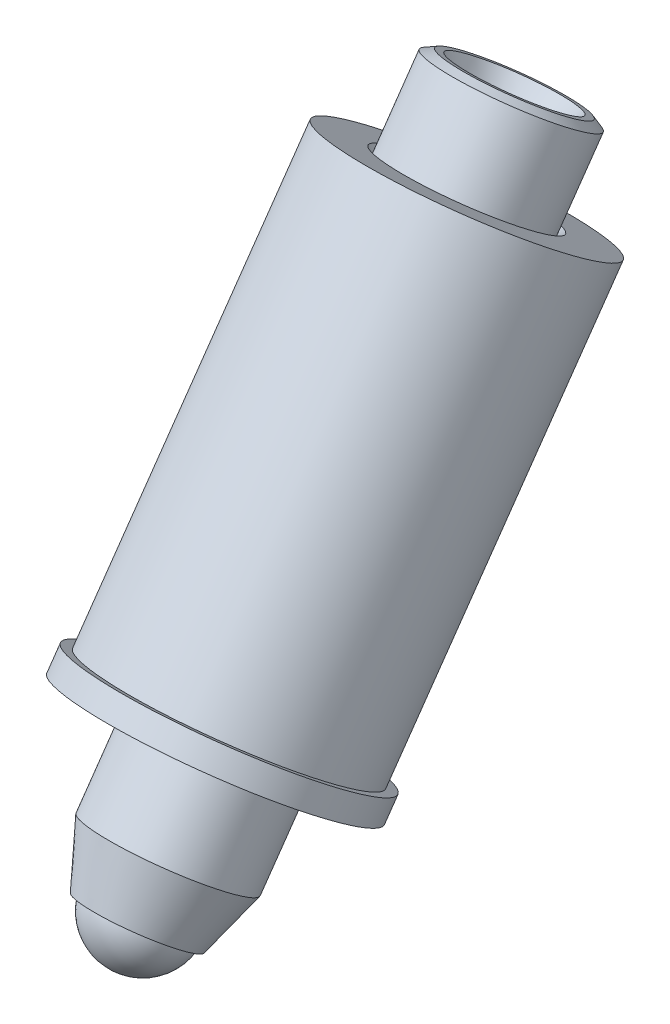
ISO-10303-21;
HEADER;
FILE_DESCRIPTION(('STEP AP214'),'2;1');
FILE_NAME('part.step','',(''),(''),'','','');
FILE_SCHEMA(('AUTOMOTIVE_DESIGN { 1 0 10303 214 1 1 1 1 }'));
ENDSEC;
DATA;
#1=APPLICATION_CONTEXT('core data for automotive mechanical design processes');
#2=APPLICATION_PROTOCOL_DEFINITION('international standard','automotive_design',2000,#1);
#3=PRODUCT_CONTEXT('',#1,'mechanical');
#4=PRODUCT('Part','Part','',(#3));
#5=PRODUCT_RELATED_PRODUCT_CATEGORY('part','',(#4));
#6=PRODUCT_DEFINITION_FORMATION('','',#4);
#7=PRODUCT_DEFINITION_CONTEXT('part definition',#1,'design');
#8=PRODUCT_DEFINITION('design','',#6,#7);
#9=PRODUCT_DEFINITION_SHAPE('','',#8);
#10=(LENGTH_UNIT() NAMED_UNIT(*) SI_UNIT(.MILLI.,.METRE.));
#11=(NAMED_UNIT(*) PLANE_ANGLE_UNIT() SI_UNIT($,.RADIAN.));
#12=(NAMED_UNIT(*) SI_UNIT($,.STERADIAN.) SOLID_ANGLE_UNIT());
#13=UNCERTAINTY_MEASURE_WITH_UNIT(LENGTH_MEASURE(1.E-05),#10,'distance_accuracy_value','');
#14=(GEOMETRIC_REPRESENTATION_CONTEXT(3) GLOBAL_UNCERTAINTY_ASSIGNED_CONTEXT((#13)) GLOBAL_UNIT_ASSIGNED_CONTEXT((#10,
#11,#12)) REPRESENTATION_CONTEXT('',''));
#15=CARTESIAN_POINT('',(0.,0.,0.));
#16=DIRECTION('',(0.,0.,1.));
#17=DIRECTION('',(1.,0.,0.));
#18=AXIS2_PLACEMENT_3D('',#15,#16,#17);
#19=CARTESIAN_POINT('',(10.8040317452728,7.16714205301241,12.9440832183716));
#20=DIRECTION('',(-0.877031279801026,-0.275646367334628,-0.393491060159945));
#21=DIRECTION('',(-0.409349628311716,0.,0.912377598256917));
#22=AXIS2_PLACEMENT_3D('',#19,#20,#21);
#23=PLANE('',#22);
#24=DIRECTION('',(0.,-0.819033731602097,0.573745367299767));
#25=VECTOR('',#24,1.);
#26=CARTESIAN_POINT('',(10.3879643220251,7.20007101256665,13.8483665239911));
#27=LINE('',#26,#25);
#28=CARTESIAN_POINT('',(10.3879643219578,7.20007101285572,13.8483665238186));
#29=VERTEX_POINT('',#28);
#30=CARTESIAN_POINT('',(10.3879643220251,4.32678473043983,15.8611464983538));
#31=VERTEX_POINT('',#30);
#32=EDGE_CURVE('E148',#29,#31,#27,.T.);
#33=ORIENTED_EDGE('',*,*,#32,.T.);
#34=DIRECTION('',(-0.48043327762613,0.503192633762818,0.718318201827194));
#35=VECTOR('',#34,1.);
#36=CARTESIAN_POINT('',(10.4622510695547,4.24897882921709,15.7500769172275));
#37=LINE('',#36,#35);
#38=CARTESIAN_POINT('',(10.4622510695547,4.24897882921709,15.7500769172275));
#39=VERTEX_POINT('',#38);
#40=EDGE_CURVE('E241',#39,#31,#37,.T.);
#41=ORIENTED_EDGE('',*,*,#40,.F.);
#42=DIRECTION('',(0.,0.819033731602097,-0.573745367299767));
#43=VECTOR('',#42,1.);
#44=CARTESIAN_POINT('',(10.4622510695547,5.06801256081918,15.1763315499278));
#45=LINE('',#44,#43);
#46=CARTESIAN_POINT('',(10.4622510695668,7.02860094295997,13.8029100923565));
#47=VERTEX_POINT('',#46);
#48=EDGE_CURVE('E240',#39,#47,#45,.T.);
#49=ORIENTED_EDGE('',*,*,#48,.T.);
#50=CARTESIAN_POINT('',(10.3879643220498,7.20007101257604,13.8483665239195));
#51=CARTESIAN_POINT('',(10.3937962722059,7.1853552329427,13.8456766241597));
#52=CARTESIAN_POINT('',(10.3997066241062,7.17070787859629,13.8427640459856));
#53=CARTESIAN_POINT('',(10.4116921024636,7.14162628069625,13.8364223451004));
#54=CARTESIAN_POINT('',(10.4177669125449,7.12719170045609,13.8329941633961));
#55=CARTESIAN_POINT('',(10.4301119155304,7.09855444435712,13.8255398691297));
#56=CARTESIAN_POINT('',(10.4363821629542,7.08435183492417,13.8215135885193));
#57=CARTESIAN_POINT('',(10.4491464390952,7.05623418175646,13.8127608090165));
#58=CARTESIAN_POINT('',(10.455640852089,7.04231970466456,13.8080330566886));
#59=CARTESIAN_POINT('',(10.4622510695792,7.02860094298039,13.8029100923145));
#60=B_SPLINE_CURVE_WITH_KNOTS('',3,(#50,#51,#52,#53,#54,#55,#56,#57,#58,#59),.UNSPECIFIED.,.F.,
.F.,(4,2,2,2,4),(0.,0.0481710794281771,0.0962552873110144,0.144353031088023,0.192537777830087),.UNSPECIFIED.);
#61=EDGE_CURVE('E20',#29,#47,#60,.T.);
#62=ORIENTED_EDGE('',*,*,#61,.F.);
#63=EDGE_LOOP('',(#33,#41,#49,#62));
#64=FACE_BOUND('',#63,.T.);
#65=ADVANCED_FACE('F16',(#64),#23,.F.);
#66=CARTESIAN_POINT('',(10.8040317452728,7.16714205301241,12.9440832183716));
#67=DIRECTION('',(-0.877031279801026,-0.275646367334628,-0.393491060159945));
#68=DIRECTION('',(-0.409349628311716,0.,0.912377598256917));
#69=AXIS2_PLACEMENT_3D('',#66,#67,#68);
#70=PLANE('',#69);
#71=DIRECTION('',(0.,0.819033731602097,-0.573745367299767));
#72=VECTOR('',#71,1.);
#73=CARTESIAN_POINT('',(10.7297449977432,4.78784675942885,14.7763889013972));
#74=LINE('',#73,#72);
#75=CARTESIAN_POINT('',(10.7297449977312,6.74843514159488,13.4029674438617));
#76=VERTEX_POINT('',#75);
#77=CARTESIAN_POINT('',(10.7297449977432,3.96881302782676,15.350134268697));
#78=VERTEX_POINT('',#77);
#79=EDGE_CURVE('E172',#76,#78,#74,.F.);
#80=ORIENTED_EDGE('',*,*,#79,.T.);
#81=DIRECTION('',(-0.480433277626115,0.503192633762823,0.7183182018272));
#82=VECTOR('',#81,1.);
#83=CARTESIAN_POINT('',(10.8040317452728,3.89100712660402,15.2390646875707));
#84=LINE('',#83,#82);
#85=CARTESIAN_POINT('',(10.8040317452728,3.89100712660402,15.2390646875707));
#86=VERTEX_POINT('',#85);
#87=EDGE_CURVE('E164',#86,#78,#84,.T.);
#88=ORIENTED_EDGE('',*,*,#87,.F.);
#89=DIRECTION('',(0.,0.819033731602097,-0.573745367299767));
#90=VECTOR('',#89,1.);
#91=CARTESIAN_POINT('',(10.8040317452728,7.1671420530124,12.9440832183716));
#92=LINE('',#91,#90);
#93=CARTESIAN_POINT('',(10.8040317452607,6.76429340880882,13.2262847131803));
#94=VERTEX_POINT('',#93);
#95=EDGE_CURVE('E169',#86,#94,#92,.T.);
#96=ORIENTED_EDGE('',*,*,#95,.T.);
#97=CARTESIAN_POINT('',(10.7297449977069,6.74843514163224,13.4029674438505));
#98=CARTESIAN_POINT('',(10.7363552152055,6.74830718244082,13.388323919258));
#99=CARTESIAN_POINT('',(10.7428496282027,6.74861751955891,13.3736314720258));
#100=CARTESIAN_POINT('',(10.7556139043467,6.74999726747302,13.3442153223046));
#101=CARTESIAN_POINT('',(10.76188415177,6.7510653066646,13.3294917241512));
#102=CARTESIAN_POINT('',(10.7742291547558,6.75384292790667,13.3000308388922));
#103=CARTESIAN_POINT('',(10.7803039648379,6.75555232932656,13.2852935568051));
#104=CARTESIAN_POINT('',(10.7922894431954,6.75952740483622,13.2557951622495));
#105=CARTESIAN_POINT('',(10.7981997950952,6.76179407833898,13.2410340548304));
#106=CARTESIAN_POINT('',(10.8040317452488,6.76429340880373,13.2262847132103));
#107=B_SPLINE_CURVE_WITH_KNOTS('',3,(#97,#98,#99,#100,#101,#102,#103,#104,#105,#106),
.UNSPECIFIED.,.F.,.F.,(4,2,2,2,4),(0.,0.0481847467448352,0.096282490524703,0.14436669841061,
0.192537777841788),.UNSPECIFIED.);
#108=EDGE_CURVE('E176',#76,#94,#107,.T.);
#109=ORIENTED_EDGE('',*,*,#108,.F.);
#110=EDGE_LOOP('',(#80,#88,#96,#109));
#111=FACE_BOUND('',#110,.T.);
#112=ADVANCED_FACE('F166',(#111),#70,.F.);
#113=CARTESIAN_POINT('',(11.2537714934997,4.3156307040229,15.8452238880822));
#114=DIRECTION('',(0.,0.819033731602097,-0.573745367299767));
#115=DIRECTION('',(0.,0.573745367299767,0.819033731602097));
#116=AXIS2_PLACEMENT_3D('',#113,#114,#115);
#117=PLANE('',#116);
#118=DIRECTION('',(0.999748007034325,-0.0128795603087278,-0.0183858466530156));
#119=VECTOR('',#118,1.);
#120=CARTESIAN_POINT('',(11.6698389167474,3.87985310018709,15.2231420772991));
#121=LINE('',#120,#119);
#122=CARTESIAN_POINT('',(10.9586172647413,3.88901563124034,15.2362217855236));
#123=VERTEX_POINT('',#122);
#124=EDGE_CURVE('E175',#123,#86,#121,.F.);
#125=ORIENTED_EDGE('',*,*,#124,.T.);
#126=ORIENTED_EDGE('',*,*,#87,.T.);
#127=CARTESIAN_POINT('',(11.2537714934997,4.31563070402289,15.8452238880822));
#128=DIRECTION('',(0.,0.819033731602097,-0.573745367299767));
#129=DIRECTION('',(0.,0.573745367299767,0.819033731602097));
#130=AXIS2_PLACEMENT_3D('',#127,#128,#129);
#131=CIRCLE('',#130,0.8);
#132=EDGE_CURVE('E180',#78,#123,#131,.F.);
#133=ORIENTED_EDGE('',*,*,#132,.T.);
#134=EDGE_LOOP('',(#125,#126,#133));
#135=FACE_BOUND('',#134,.T.);
#136=ADVANCED_FACE('F179',(#135),#117,.T.);
#137=CARTESIAN_POINT('',(11.6698389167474,7.15598802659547,12.9281606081));
#138=DIRECTION('',(-0.0224482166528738,-0.573600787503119,-0.818827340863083));
#139=DIRECTION('',(0.,0.819033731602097,-0.573745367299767));
#140=AXIS2_PLACEMENT_3D('',#137,#138,#139);
#141=PLANE('',#140);
#142=ORIENTED_EDGE('',*,*,#95,.F.);
#143=ORIENTED_EDGE('',*,*,#124,.F.);
#144=DIRECTION('',(0.,0.819033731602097,-0.573745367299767));
#145=VECTOR('',#144,1.);
#146=CARTESIAN_POINT('',(10.9586172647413,4.70804936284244,14.6624764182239));
#147=LINE('',#146,#145);
#148=CARTESIAN_POINT('',(10.9586172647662,6.66863774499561,13.2890549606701));
#149=VERTEX_POINT('',#148);
#150=EDGE_CURVE('E498',#123,#149,#147,.T.);
#151=ORIENTED_EDGE('',*,*,#150,.T.);
#152=CARTESIAN_POINT('',(10.8040317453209,6.7642934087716,13.2262847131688));
#153=CARTESIAN_POINT('',(10.8161676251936,6.75552950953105,13.2320912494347));
#154=CARTESIAN_POINT('',(10.8284666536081,6.74691404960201,13.237789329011));
#155=CARTESIAN_POINT('',(10.8534075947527,6.73006440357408,13.2489089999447));
#156=CARTESIAN_POINT('',(10.8660488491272,6.72182955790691,13.2543310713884));
#157=CARTESIAN_POINT('',(10.891737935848,6.70579117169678,13.2648619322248));
#158=CARTESIAN_POINT('',(10.9047858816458,6.69798775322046,13.2699706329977));
#159=CARTESIAN_POINT('',(10.9313474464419,6.68289686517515,13.2798138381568));
#160=CARTESIAN_POINT('',(10.9448618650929,6.67561035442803,13.2845476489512));
#161=CARTESIAN_POINT('',(10.9586172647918,6.66863774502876,13.2890549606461));
#162=B_SPLINE_CURVE_WITH_KNOTS('',3,(#152,#153,#154,#155,#156,#157,#158,#159,#160,#161),
.UNSPECIFIED.,.F.,.F.,(4,2,2,2,4),(0.,0.048171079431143,0.0962552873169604,0.144353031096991,
0.192537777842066),.UNSPECIFIED.);
#163=EDGE_CURVE('E186',#94,#149,#162,.T.);
#164=ORIENTED_EDGE('',*,*,#163,.F.);
#165=EDGE_LOOP('',(#142,#143,#151,#164));
#166=FACE_BOUND('',#165,.T.);
#167=ADVANCED_FACE('F185',(#166),#141,.F.);
#168=CARTESIAN_POINT('',(11.6698389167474,7.15598802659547,12.9281606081));
#169=DIRECTION('',(-0.0224482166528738,-0.573600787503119,-0.818827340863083));
#170=DIRECTION('',(0.,0.819033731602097,-0.573745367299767));
#171=AXIS2_PLACEMENT_3D('',#168,#169,#170);
#172=PLANE('',#171);
#173=DIRECTION('',(0.,0.819033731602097,-0.573745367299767));
#174=VECTOR('',#173,1.);
#175=CARTESIAN_POINT('',(11.5152533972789,4.70087832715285,14.6522396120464));
#176=LINE('',#175,#174);
#177=CARTESIAN_POINT('',(11.515253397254,6.66146670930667,13.2788181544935));
#178=VERTEX_POINT('',#177);
#179=CARTESIAN_POINT('',(11.5152533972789,3.88184459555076,15.2259849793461));
#180=VERTEX_POINT('',#179);
#181=EDGE_CURVE('E494',#178,#180,#176,.F.);
#182=ORIENTED_EDGE('',*,*,#181,.T.);
#183=DIRECTION('',(-0.999748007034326,0.0128795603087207,0.0183858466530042));
#184=VECTOR('',#183,1.);
#185=CARTESIAN_POINT('',(11.6698389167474,3.87985310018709,15.2231420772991));
#186=LINE('',#185,#184);
#187=CARTESIAN_POINT('',(11.6698389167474,3.87985310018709,15.2231420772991));
#188=VERTEX_POINT('',#187);
#189=EDGE_CURVE('E195',#188,#180,#186,.T.);
#190=ORIENTED_EDGE('',*,*,#189,.F.);
#191=DIRECTION('',(0.,0.819033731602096,-0.573745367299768));
#192=VECTOR('',#191,1.);
#193=CARTESIAN_POINT('',(11.6698389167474,3.87985310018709,15.2231420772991));
#194=LINE('',#193,#192);
#195=CARTESIAN_POINT('',(11.6698389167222,6.75313938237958,13.2103621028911));
#196=VERTEX_POINT('',#195);
#197=EDGE_CURVE('E201',#188,#196,#194,.T.);
#198=ORIENTED_EDGE('',*,*,#197,.T.);
#199=CARTESIAN_POINT('',(11.5152533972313,6.66146670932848,13.27881815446));
#200=CARTESIAN_POINT('',(11.5290087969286,6.66808490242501,13.27380490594));
#201=CARTESIAN_POINT('',(11.5425232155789,6.67502320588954,13.2685740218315));
#202=CARTESIAN_POINT('',(11.5690847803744,6.6894297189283,13.2577538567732));
#203=CARTESIAN_POINT('',(11.5821327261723,6.69689694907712,13.252165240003));
#204=CARTESIAN_POINT('',(11.6078218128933,6.71227344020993,13.2406895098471));
#205=CARTESIAN_POINT('',(11.6204630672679,6.72018257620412,13.2348024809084));
#206=CARTESIAN_POINT('',(11.6454040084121,6.73638960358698,13.2227654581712));
#207=CARTESIAN_POINT('',(11.657703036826,6.74468817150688,13.2166150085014));
#208=CARTESIAN_POINT('',(11.6698389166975,6.75313938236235,13.2103621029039));
#209=B_SPLINE_CURVE_WITH_KNOTS('',3,(#199,#200,#201,#202,#203,#204,#205,#206,#207,#208),
.UNSPECIFIED.,.F.,.F.,(4,2,2,2,4),(0.,0.0481847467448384,0.0962824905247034,0.14436669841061,
0.192537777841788),.UNSPECIFIED.);
#210=EDGE_CURVE('E188',#178,#196,#209,.T.);
#211=ORIENTED_EDGE('',*,*,#210,.F.);
#212=EDGE_LOOP('',(#182,#190,#198,#211));
#213=FACE_BOUND('',#212,.T.);
#214=ADVANCED_FACE('F625',(#213),#172,.F.);
#215=CARTESIAN_POINT('',(11.2537714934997,4.3156307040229,15.8452238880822));
#216=DIRECTION('',(0.,0.819033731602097,-0.573745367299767));
#217=DIRECTION('',(0.,0.573745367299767,0.819033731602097));
#218=AXIS2_PLACEMENT_3D('',#215,#216,#217);
#219=PLANE('',#218);
#220=DIRECTION('',(-0.519314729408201,-0.49031307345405,-0.69993235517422));
#221=VECTOR('',#220,1.);
#222=CARTESIAN_POINT('',(11.7501376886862,3.95566750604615,15.3313687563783));
#223=LINE('',#222,#221);
#224=CARTESIAN_POINT('',(11.7501376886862,3.95566750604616,15.3313687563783));
#225=VERTEX_POINT('',#224);
#226=EDGE_CURVE('E198',#225,#188,#223,.T.);
#227=ORIENTED_EDGE('',*,*,#226,.T.);
#228=ORIENTED_EDGE('',*,*,#189,.T.);
#229=CARTESIAN_POINT('',(11.2537714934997,4.31563070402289,15.8452238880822));
#230=DIRECTION('',(0.,0.819033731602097,-0.573745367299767));
#231=DIRECTION('',(0.,0.573745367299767,0.819033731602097));
#232=AXIS2_PLACEMENT_3D('',#229,#230,#231);
#233=CIRCLE('',#232,0.8);
#234=EDGE_CURVE('E489',#180,#225,#233,.F.);
#235=ORIENTED_EDGE('',*,*,#234,.T.);
#236=EDGE_LOOP('',(#227,#228,#235));
#237=FACE_BOUND('',#236,.T.);
#238=ADVANCED_FACE('F519',(#237),#219,.T.);
#239=CARTESIAN_POINT('',(12.1195786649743,7.58061160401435,13.5343198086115));
#240=DIRECTION('',(0.854583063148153,-0.297954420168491,-0.425336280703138));
#241=DIRECTION('',(-0.445574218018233,0.,-0.895245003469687));
#242=AXIS2_PLACEMENT_3D('',#239,#240,#241);
#243=PLANE('',#242);
#244=ORIENTED_EDGE('',*,*,#197,.F.);
#245=ORIENTED_EDGE('',*,*,#226,.F.);
#246=DIRECTION('',(0.,0.819033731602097,-0.573745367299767));
#247=VECTOR('',#246,1.);
#248=CARTESIAN_POINT('',(11.7501376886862,4.77470123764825,14.7576233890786));
#249=LINE('',#248,#247);
#250=CARTESIAN_POINT('',(11.7501376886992,6.73528961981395,13.3842019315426));
#251=VERTEX_POINT('',#250);
#252=EDGE_CURVE('E458',#225,#251,#249,.T.);
#253=ORIENTED_EDGE('',*,*,#252,.T.);
#254=CARTESIAN_POINT('',(11.669838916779,6.7531393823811,13.210362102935));
#255=CARTESIAN_POINT('',(11.6761428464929,6.75048370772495,13.2248882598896));
#256=CARTESIAN_POINT('',(11.6825315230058,6.74805858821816,13.2394231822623));
#257=CARTESIAN_POINT('',(11.6954869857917,6.74376220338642,13.2684629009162));
#258=CARTESIAN_POINT('',(11.7020534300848,6.74188994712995,13.2829677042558));
#259=CARTESIAN_POINT('',(11.7153975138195,6.73878137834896,13.311956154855));
#260=CARTESIAN_POINT('',(11.7221752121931,6.73754524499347,13.3264397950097));
#261=CARTESIAN_POINT('',(11.7359725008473,6.73582330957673,13.3553674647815));
#262=CARTESIAN_POINT('',(11.7429925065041,6.73533886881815,13.3698113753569));
#263=CARTESIAN_POINT('',(11.7501376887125,6.73528961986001,13.3842019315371));
#264=B_SPLINE_CURVE_WITH_KNOTS('',3,(#254,#255,#256,#257,#258,#259,#260,#261,#262,#263),
.UNSPECIFIED.,.F.,.F.,(4,2,2,2,4),(0.,0.0481710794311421,0.0962552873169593,0.144353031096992,
0.192537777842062),.UNSPECIFIED.);
#265=EDGE_CURVE('E204',#196,#251,#264,.T.);
#266=ORIENTED_EDGE('',*,*,#265,.F.);
#267=EDGE_LOOP('',(#244,#245,#253,#266));
#268=FACE_BOUND('',#267,.T.);
#269=ADVANCED_FACE('F524',(#268),#243,.F.);
#270=CARTESIAN_POINT('',(11.2537714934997,2.6775632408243,16.9927146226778));
#271=DIRECTION('',(0.,0.819033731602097,-0.573745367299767));
#272=DIRECTION('',(0.,0.573745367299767,0.819033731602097));
#273=AXIS2_PLACEMENT_3D('',#270,#271,#272);
#274=CONICAL_SURFACE('',#273,0.800000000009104,1.04719755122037);
#275=CARTESIAN_POINT('',(11.2537714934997,2.29926776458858,17.2577162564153));
#276=VERTEX_POINT('',#275);
#277=VERTEX_LOOP('',#276);
#278=FACE_BOUND('',#277,.T.);
#279=CARTESIAN_POINT('',(11.2537714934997,2.67756324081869,16.9927146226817));
#280=DIRECTION('',(0.,0.819033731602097,-0.573745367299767));
#281=DIRECTION('',(0.,0.573745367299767,0.819033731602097));
#282=AXIS2_PLACEMENT_3D('',#279,#280,#281);
#283=CIRCLE('',#282,0.8);
#284=CARTESIAN_POINT('',(11.2537714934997,3.13655953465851,17.6479416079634));
#285=VERTEX_POINT('',#284);
#286=EDGE_CURVE('E456',#285,#285,#283,.T.);
#287=ORIENTED_EDGE('',*,*,#286,.T.);
#288=EDGE_LOOP('',(#287));
#289=FACE_BOUND('',#288,.T.);
#290=ADVANCED_FACE('F614',(#278,#289),#274,.F.);
#291=CARTESIAN_POINT('',(11.7035112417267,8.01638920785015,14.1564016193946));
#292=DIRECTION('',(0.877031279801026,0.275646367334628,0.393491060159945));
#293=DIRECTION('',(0.409349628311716,0.,-0.912377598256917));
#294=AXIS2_PLACEMENT_3D('',#291,#292,#293);
#295=PLANE('',#294);
#296=DIRECTION('',(0.,0.819033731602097,-0.573745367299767));
#297=VECTOR('',#296,1.);
#298=CARTESIAN_POINT('',(11.7777979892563,5.48148211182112,15.7665681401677));
#299=LINE('',#298,#297);
#300=CARTESIAN_POINT('',(11.7777979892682,7.44207049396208,14.3931466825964));
#301=VERTEX_POINT('',#300);
#302=CARTESIAN_POINT('',(11.7777979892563,4.66244838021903,16.3403135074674));
#303=VERTEX_POINT('',#302);
#304=EDGE_CURVE('E455',#301,#303,#299,.F.);
#305=ORIENTED_EDGE('',*,*,#304,.T.);
#306=DIRECTION('',(0.480433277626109,-0.503192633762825,-0.718318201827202));
#307=VECTOR('',#306,1.);
#308=CARTESIAN_POINT('',(11.7035112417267,4.74025428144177,16.4513830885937));
#309=LINE('',#308,#307);
#310=CARTESIAN_POINT('',(11.7035112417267,4.74025428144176,16.4513830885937));
#311=VERTEX_POINT('',#310);
#312=EDGE_CURVE('E207',#311,#303,#309,.T.);
#313=ORIENTED_EDGE('',*,*,#312,.F.);
#314=DIRECTION('',(0.,-0.819033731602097,0.573745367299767));
#315=VECTOR('',#314,1.);
#316=CARTESIAN_POINT('',(11.7035112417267,8.01638920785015,14.1564016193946));
#317=LINE('',#316,#315);
#318=CARTESIAN_POINT('',(11.7035112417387,7.61354056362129,14.4386031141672));
#319=VERTEX_POINT('',#318);
#320=EDGE_CURVE('E214',#311,#319,#317,.F.);
#321=ORIENTED_EDGE('',*,*,#320,.T.);
#322=CARTESIAN_POINT('',(11.7777979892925,7.44207049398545,14.3931466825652));
#323=CARTESIAN_POINT('',(11.771187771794,7.45578925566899,14.3982696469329));
#324=CARTESIAN_POINT('',(11.7646933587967,7.46970373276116,14.4029973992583));
#325=CARTESIAN_POINT('',(11.7519290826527,7.49782138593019,14.4117501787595));
#326=CARTESIAN_POINT('',(11.7456588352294,7.51202399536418,14.4157764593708));
#327=CARTESIAN_POINT('',(11.7333138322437,7.54066125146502,14.423230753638));
#328=CARTESIAN_POINT('',(11.7272390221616,7.555095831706,14.4266589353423));
#329=CARTESIAN_POINT('',(11.715253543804,7.58417742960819,14.4330006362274));
#330=CARTESIAN_POINT('',(11.7093431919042,7.59882478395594,14.4359132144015));
#331=CARTESIAN_POINT('',(11.7035112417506,7.61354056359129,14.4386031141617));
#332=B_SPLINE_CURVE_WITH_KNOTS('',3,(#322,#323,#324,#325,#326,#327,#328,#329,#330,#331),
.UNSPECIFIED.,.F.,.F.,(4,2,2,2,4),(0.,0.0481847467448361,0.0962824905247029,0.144366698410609,
0.192537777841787),.UNSPECIFIED.);
#333=EDGE_CURVE('E211',#301,#319,#332,.T.);
#334=ORIENTED_EDGE('',*,*,#333,.F.);
#335=EDGE_LOOP('',(#305,#313,#321,#334));
#336=FACE_BOUND('',#335,.T.);
#337=ADVANCED_FACE('F610',(#336),#295,.F.);
#338=CARTESIAN_POINT('',(11.2537714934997,4.3156307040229,15.8452238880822));
#339=DIRECTION('',(0.,0.819033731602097,-0.573745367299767));
#340=DIRECTION('',(0.,0.573745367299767,0.819033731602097));
#341=AXIS2_PLACEMENT_3D('',#338,#339,#340);
#342=PLANE('',#341);
#343=DIRECTION('',(0.999748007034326,-0.0128795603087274,-0.018385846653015));
#344=VECTOR('',#343,1.);
#345=CARTESIAN_POINT('',(10.8377040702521,4.75140830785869,16.4673056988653));
#346=LINE('',#345,#344);
#347=CARTESIAN_POINT('',(11.5489257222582,4.74224577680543,16.4542259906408));
#348=VERTEX_POINT('',#347);
#349=EDGE_CURVE('E210',#348,#311,#346,.T.);
#350=ORIENTED_EDGE('',*,*,#349,.T.);
#351=ORIENTED_EDGE('',*,*,#312,.T.);
#352=CARTESIAN_POINT('',(11.2537714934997,4.31563070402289,15.8452238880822));
#353=DIRECTION('',(0.,0.819033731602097,-0.573745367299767));
#354=DIRECTION('',(0.,0.573745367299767,0.819033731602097));
#355=AXIS2_PLACEMENT_3D('',#352,#353,#354);
#356=CIRCLE('',#355,0.8);
#357=EDGE_CURVE('E479',#303,#348,#356,.F.);
#358=ORIENTED_EDGE('',*,*,#357,.T.);
#359=EDGE_LOOP('',(#350,#351,#358));
#360=FACE_BOUND('',#359,.T.);
#361=ADVANCED_FACE('F606',(#360),#342,.T.);
#362=CARTESIAN_POINT('',(10.8377040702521,8.02754323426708,14.1723242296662));
#363=DIRECTION('',(0.0224482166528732,0.573600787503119,0.818827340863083));
#364=DIRECTION('',(0.,-0.819033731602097,0.573745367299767));
#365=AXIS2_PLACEMENT_3D('',#362,#363,#364);
#366=PLANE('',#365);
#367=ORIENTED_EDGE('',*,*,#320,.F.);
#368=ORIENTED_EDGE('',*,*,#349,.F.);
#369=DIRECTION('',(0.,0.819033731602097,-0.573745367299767));
#370=VECTOR('',#369,1.);
#371=CARTESIAN_POINT('',(11.5489257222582,5.56127950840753,15.880480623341));
#372=LINE('',#371,#370);
#373=CARTESIAN_POINT('',(11.5489257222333,7.52186789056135,14.5070591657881));
#374=VERTEX_POINT('',#373);
#375=EDGE_CURVE('E476',#348,#374,#372,.T.);
#376=ORIENTED_EDGE('',*,*,#375,.T.);
#377=CARTESIAN_POINT('',(11.7035112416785,7.61354056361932,14.4386031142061));
#378=CARTESIAN_POINT('',(11.6913753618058,7.60508935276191,14.4448560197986));
#379=CARTESIAN_POINT('',(11.6790763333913,7.59679078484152,14.4510064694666));
#380=CARTESIAN_POINT('',(11.6541353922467,7.58058375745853,14.4630434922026));
#381=CARTESIAN_POINT('',(11.6414941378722,7.57267462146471,14.468930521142));
#382=CARTESIAN_POINT('',(11.6158050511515,7.55729813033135,14.4804062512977));
#383=CARTESIAN_POINT('',(11.6027571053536,7.54983090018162,14.4859948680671));
#384=CARTESIAN_POINT('',(11.5761955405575,7.53542438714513,14.4968150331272));
#385=CARTESIAN_POINT('',(11.5626811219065,7.52848608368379,14.5020459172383));
#386=CARTESIAN_POINT('',(11.5489257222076,7.52186789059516,14.5070591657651));
#387=B_SPLINE_CURVE_WITH_KNOTS('',3,(#377,#378,#379,#380,#381,#382,#383,#384,#385,#386),
.UNSPECIFIED.,.F.,.F.,(4,2,2,2,4),(0.,0.0481710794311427,0.0962552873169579,0.14435303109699,
0.192537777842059),.UNSPECIFIED.);
#388=EDGE_CURVE('E217',#319,#374,#387,.T.);
#389=ORIENTED_EDGE('',*,*,#388,.F.);
#390=EDGE_LOOP('',(#367,#368,#376,#389));
#391=FACE_BOUND('',#390,.T.);
#392=ADVANCED_FACE('F353',(#391),#366,.F.);
#393=CARTESIAN_POINT('',(10.8377040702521,8.02754323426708,14.1723242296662));
#394=DIRECTION('',(0.0224482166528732,0.573600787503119,0.818827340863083));
#395=DIRECTION('',(0.,-0.819033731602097,0.573745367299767));
#396=AXIS2_PLACEMENT_3D('',#393,#394,#395);
#397=PLANE('',#396);
#398=DIRECTION('',(0.,0.819033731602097,-0.573745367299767));
#399=VECTOR('',#398,1.);
#400=CARTESIAN_POINT('',(10.9922895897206,5.56845054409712,15.8907174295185));
#401=LINE('',#400,#399);
#402=CARTESIAN_POINT('',(10.9922895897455,7.52903892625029,14.5172959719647));
#403=VERTEX_POINT('',#402);
#404=CARTESIAN_POINT('',(10.9922895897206,4.74941681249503,16.4644627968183));
#405=VERTEX_POINT('',#404);
#406=EDGE_CURVE('E472',#403,#405,#401,.F.);
#407=ORIENTED_EDGE('',*,*,#406,.T.);
#408=DIRECTION('',(0.999748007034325,-0.0128795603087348,-0.0183858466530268));
#409=VECTOR('',#408,1.);
#410=CARTESIAN_POINT('',(10.8377040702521,4.7514083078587,16.4673056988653));
#411=LINE('',#410,#409);
#412=CARTESIAN_POINT('',(10.8377040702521,4.7514083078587,16.4673056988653));
#413=VERTEX_POINT('',#412);
#414=EDGE_CURVE('E220',#413,#405,#411,.T.);
#415=ORIENTED_EDGE('',*,*,#414,.F.);
#416=DIRECTION('',(0.,0.819033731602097,-0.573745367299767));
#417=VECTOR('',#416,1.);
#418=CARTESIAN_POINT('',(10.8377040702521,4.7514083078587,16.4673056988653));
#419=LINE('',#418,#417);
#420=CARTESIAN_POINT('',(10.8377040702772,7.62469459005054,14.4545257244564));
#421=VERTEX_POINT('',#420);
#422=EDGE_CURVE('E227',#413,#421,#419,.T.);
#423=ORIENTED_EDGE('',*,*,#422,.T.);
#424=CARTESIAN_POINT('',(10.9922895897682,7.52903892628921,14.5172959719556));
#425=CARTESIAN_POINT('',(10.9785341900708,7.5360115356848,14.512788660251));
#426=CARTESIAN_POINT('',(10.9650197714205,7.54329804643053,14.5080548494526));
#427=CARTESIAN_POINT('',(10.938458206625,7.55838893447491,14.4982116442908));
#428=CARTESIAN_POINT('',(10.9254102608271,7.56619235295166,14.493102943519));
#429=CARTESIAN_POINT('',(10.8997211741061,7.58223073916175,14.4825720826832));
#430=CARTESIAN_POINT('',(10.8870799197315,7.59046558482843,14.477150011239));
#431=CARTESIAN_POINT('',(10.8621389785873,7.60731523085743,14.4660303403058));
#432=CARTESIAN_POINT('',(10.8498399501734,7.61593069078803,14.4603322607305));
#433=CARTESIAN_POINT('',(10.8377040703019,7.62469459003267,14.4545257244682));
#434=B_SPLINE_CURVE_WITH_KNOTS('',3,(#424,#425,#426,#427,#428,#429,#430,#431,#432,#433),
.UNSPECIFIED.,.F.,.F.,(4,2,2,2,4),(0.,0.0481847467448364,0.0962824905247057,0.14436669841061,
0.192537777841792),.UNSPECIFIED.);
#435=EDGE_CURVE('E224',#403,#421,#434,.T.);
#436=ORIENTED_EDGE('',*,*,#435,.F.);
#437=EDGE_LOOP('',(#407,#415,#423,#436));
#438=FACE_BOUND('',#437,.T.);
#439=ADVANCED_FACE('F348',(#438),#397,.F.);
#440=CARTESIAN_POINT('',(11.2537714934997,4.3156307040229,15.8452238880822));
#441=DIRECTION('',(0.,0.819033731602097,-0.573745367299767));
#442=DIRECTION('',(0.,0.573745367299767,0.819033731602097));
#443=AXIS2_PLACEMENT_3D('',#440,#441,#442);
#444=PLANE('',#443);
#445=DIRECTION('',(0.519314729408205,0.490313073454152,0.699932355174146));
#446=VECTOR('',#445,1.);
#447=CARTESIAN_POINT('',(10.7574052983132,4.67559390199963,16.3590790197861));
#448=LINE('',#447,#446);
#449=CARTESIAN_POINT('',(10.7574052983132,4.67559390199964,16.3590790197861));
#450=VERTEX_POINT('',#449);
#451=EDGE_CURVE('E223',#450,#413,#448,.T.);
#452=ORIENTED_EDGE('',*,*,#451,.T.);
#453=ORIENTED_EDGE('',*,*,#414,.T.);
#454=CARTESIAN_POINT('',(11.2537714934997,4.31563070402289,15.8452238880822));
#455=DIRECTION('',(0.,0.819033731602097,-0.573745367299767));
#456=DIRECTION('',(0.,0.573745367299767,0.819033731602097));
#457=AXIS2_PLACEMENT_3D('',#454,#455,#456);
#458=CIRCLE('',#457,0.8);
#459=EDGE_CURVE('E467',#405,#450,#458,.F.);
#460=ORIENTED_EDGE('',*,*,#459,.T.);
#461=EDGE_LOOP('',(#452,#453,#460));
#462=FACE_BOUND('',#461,.T.);
#463=ADVANCED_FACE('F352',(#462),#444,.T.);
#464=CARTESIAN_POINT('',(10.3879643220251,7.60291965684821,13.5661650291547));
#465=DIRECTION('',(-0.854583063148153,0.297954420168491,0.425336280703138));
#466=DIRECTION('',(0.445574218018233,0.,0.895245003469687));
#467=AXIS2_PLACEMENT_3D('',#464,#465,#466);
#468=PLANE('',#467);
#469=ORIENTED_EDGE('',*,*,#422,.F.);
#470=ORIENTED_EDGE('',*,*,#451,.F.);
#471=DIRECTION('',(0.,0.819033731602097,-0.573745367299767));
#472=VECTOR('',#471,1.);
#473=CARTESIAN_POINT('',(10.7574052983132,5.49462763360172,15.7853336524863));
#474=LINE('',#473,#472);
#475=CARTESIAN_POINT('',(10.7574052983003,7.45521601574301,14.4119121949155));
#476=VERTEX_POINT('',#475);
#477=EDGE_CURVE('E464',#450,#476,#474,.T.);
#478=ORIENTED_EDGE('',*,*,#477,.T.);
#479=CARTESIAN_POINT('',(10.8377040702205,7.62469459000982,14.45452572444));
#480=CARTESIAN_POINT('',(10.8314001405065,7.61013515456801,14.4520590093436));
#481=CARTESIAN_POINT('',(10.8250114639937,7.59564624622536,14.4493726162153));
#482=CARTESIAN_POINT('',(10.8120560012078,7.56688595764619,14.4434895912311));
#483=CARTESIAN_POINT('',(10.8054895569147,7.55261423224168,14.4402938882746));
#484=CARTESIAN_POINT('',(10.7921454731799,7.52430792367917,14.4333120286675));
#485=CARTESIAN_POINT('',(10.7853677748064,7.51027340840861,14.4295257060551));
#486=CARTESIAN_POINT('',(10.7715704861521,7.48249794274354,14.4212614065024));
#487=CARTESIAN_POINT('',(10.7645504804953,7.46875756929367,14.4167821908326));
#488=CARTESIAN_POINT('',(10.7574052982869,7.45521601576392,14.4119121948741));
#489=B_SPLINE_CURVE_WITH_KNOTS('',3,(#479,#480,#481,#482,#483,#484,#485,#486,#487,#488),
.UNSPECIFIED.,.F.,.F.,(4,2,2,2,4),(0.,0.0481710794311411,0.0962552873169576,0.144353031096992,
0.192537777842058),.UNSPECIFIED.);
#490=EDGE_CURVE('E230',#421,#476,#489,.T.);
#491=ORIENTED_EDGE('',*,*,#490,.F.);
#492=EDGE_LOOP('',(#469,#470,#478,#491));
#493=FACE_BOUND('',#492,.T.);
#494=ADVANCED_FACE('F358',(#493),#468,.F.);
#495=CARTESIAN_POINT('',(10.3879643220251,7.60291965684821,13.5661650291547));
#496=DIRECTION('',(-0.854583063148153,0.297954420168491,0.425336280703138));
#497=DIRECTION('',(0.445574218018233,0.,0.895245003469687));
#498=AXIS2_PLACEMENT_3D('',#495,#496,#497);
#499=PLANE('',#498);
#500=DIRECTION('',(0.,0.819033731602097,-0.573745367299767));
#501=VECTOR('',#500,1.);
#502=CARTESIAN_POINT('',(10.468263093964,5.22163286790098,15.3956278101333));
#503=LINE('',#502,#501);
#504=CARTESIAN_POINT('',(10.4682630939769,7.18222125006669,14.0222063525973));
#505=VERTEX_POINT('',#504);
#506=CARTESIAN_POINT('',(10.468263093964,4.40259913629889,15.969373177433));
#507=VERTEX_POINT('',#506);
#508=EDGE_CURVE('E459',#505,#507,#503,.F.);
#509=ORIENTED_EDGE('',*,*,#508,.T.);
#510=DIRECTION('',(0.519314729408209,0.490313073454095,0.699932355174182));
#511=VECTOR('',#510,1.);
#512=CARTESIAN_POINT('',(10.3879643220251,4.32678473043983,15.8611464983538));
#513=LINE('',#512,#511);
#514=EDGE_CURVE('E237',#31,#507,#513,.T.);
#515=ORIENTED_EDGE('',*,*,#514,.F.);
#516=ORIENTED_EDGE('',*,*,#32,.F.);
#517=CARTESIAN_POINT('',(10.4682630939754,7.1822212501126,14.0222063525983));
#518=CARTESIAN_POINT('',(10.461117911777,7.18227049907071,14.0078157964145));
#519=CARTESIAN_POINT('',(10.4540979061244,7.18275493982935,13.9933718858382));
#520=CARTESIAN_POINT('',(10.4403006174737,7.18447687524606,13.9644442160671));
#521=CARTESIAN_POINT('',(10.4335229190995,7.18571300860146,13.9499605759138));
#522=CARTESIAN_POINT('',(10.4201788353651,7.18882157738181,13.9209721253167));
#523=CARTESIAN_POINT('',(10.4136123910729,7.19069383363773,13.9064673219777));
#524=CARTESIAN_POINT('',(10.4006569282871,7.19499021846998,13.877427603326));
#525=CARTESIAN_POINT('',(10.3942682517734,7.19741533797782,13.8628926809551));
#526=CARTESIAN_POINT('',(10.3879643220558,7.20007101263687,13.8483665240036));
#527=B_SPLINE_CURVE_WITH_KNOTS('',3,(#517,#518,#519,#520,#521,#522,#523,#524,#525,#526),
.UNSPECIFIED.,.F.,.F.,(4,2,2,2,4),(0.,0.0481847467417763,0.0962824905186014,0.144366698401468,
0.192537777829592),.UNSPECIFIED.);
#528=EDGE_CURVE('E234',#505,#29,#527,.T.);
#529=ORIENTED_EDGE('',*,*,#528,.F.);
#530=EDGE_LOOP('',(#509,#515,#516,#529));
#531=FACE_BOUND('',#530,.T.);
#532=ADVANCED_FACE('F362',(#531),#499,.F.);
#533=CARTESIAN_POINT('',(11.2537714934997,4.3156307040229,15.8452238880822));
#534=DIRECTION('',(0.,0.819033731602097,-0.573745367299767));
#535=DIRECTION('',(0.,0.573745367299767,0.819033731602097));
#536=AXIS2_PLACEMENT_3D('',#533,#534,#535);
#537=PLANE('',#536);
#538=ORIENTED_EDGE('',*,*,#514,.T.);
#539=CARTESIAN_POINT('',(11.2537714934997,4.31563070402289,15.8452238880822));
#540=DIRECTION('',(0.,0.819033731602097,-0.573745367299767));
#541=DIRECTION('',(0.,0.573745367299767,0.819033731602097));
#542=AXIS2_PLACEMENT_3D('',#539,#540,#541);
#543=CIRCLE('',#542,0.8);
#544=EDGE_CURVE('E461',#507,#39,#543,.F.);
#545=ORIENTED_EDGE('',*,*,#544,.T.);
#546=ORIENTED_EDGE('',*,*,#40,.T.);
#547=EDGE_LOOP('',(#538,#545,#546));
#548=FACE_BOUND('',#547,.T.);
#549=ADVANCED_FACE('F367',(#548),#537,.T.);
#550=CARTESIAN_POINT('',(11.2537714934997,5.13466443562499,15.2714785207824));
#551=DIRECTION('',(0.,0.819033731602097,-0.573745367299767));
#552=DIRECTION('',(0.,0.573745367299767,0.819033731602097));
#553=AXIS2_PLACEMENT_3D('',#550,#551,#552);
#554=CYLINDRICAL_SURFACE('',#553,0.8);
#555=DIRECTION('',(0.,-0.819033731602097,0.573745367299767));
#556=VECTOR('',#555,1.);
#557=CARTESIAN_POINT('',(12.0452919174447,7.16190469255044,13.9932040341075));
#558=LINE('',#557,#556);
#559=CARTESIAN_POINT('',(12.0452919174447,7.16190469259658,13.9932040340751));
#560=VERTEX_POINT('',#559);
#561=CARTESIAN_POINT('',(12.0452919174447,4.38228257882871,15.9403708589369));
#562=VERTEX_POINT('',#561);
#563=EDGE_CURVE('E435',#560,#562,#558,.T.);
#564=ORIENTED_EDGE('',*,*,#563,.T.);
#565=CARTESIAN_POINT('',(11.2537714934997,4.31563070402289,15.8452238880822));
#566=DIRECTION('',(0.,0.819033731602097,-0.573745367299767));
#567=DIRECTION('',(0.,0.573745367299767,0.819033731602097));
#568=AXIS2_PLACEMENT_3D('',#565,#566,#567);
#569=CIRCLE('',#568,0.8);
#570=CARTESIAN_POINT('',(12.0392798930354,4.2286622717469,15.7210745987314));
#571=VERTEX_POINT('',#570);
#572=EDGE_CURVE('E511',#571,#562,#569,.F.);
#573=ORIENTED_EDGE('',*,*,#572,.F.);
#574=DIRECTION('',(0.,0.819033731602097,-0.573745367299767));
#575=VECTOR('',#574,1.);
#576=CARTESIAN_POINT('',(12.0392798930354,4.22866227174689,15.7210745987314));
#577=LINE('',#576,#575);
#578=CARTESIAN_POINT('',(12.0392798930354,7.00828438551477,13.7739077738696));
#579=VERTEX_POINT('',#578);
#580=EDGE_CURVE('E248',#571,#579,#577,.T.);
#581=ORIENTED_EDGE('',*,*,#580,.T.);
#582=CARTESIAN_POINT('',(11.2537714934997,7.09525281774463,13.8980570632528));
#583=DIRECTION('',(0.,0.819033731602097,-0.573745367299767));
#584=DIRECTION('',(0.,0.573745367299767,0.819033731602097));
#585=AXIS2_PLACEMENT_3D('',#582,#583,#584);
#586=CIRCLE('',#585,0.8);
#587=EDGE_CURVE('E441',#251,#579,#586,.F.);
#588=ORIENTED_EDGE('',*,*,#587,.F.);
#589=ORIENTED_EDGE('',*,*,#252,.F.);
#590=ORIENTED_EDGE('',*,*,#234,.F.);
#591=ORIENTED_EDGE('',*,*,#181,.F.);
#592=CARTESIAN_POINT('',(11.2537714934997,7.09525281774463,13.8980570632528));
#593=DIRECTION('',(0.,0.819033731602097,-0.573745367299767));
#594=DIRECTION('',(0.,0.573745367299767,0.819033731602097));
#595=AXIS2_PLACEMENT_3D('',#592,#593,#594);
#596=CIRCLE('',#595,0.8);
#597=EDGE_CURVE('E496',#149,#178,#596,.F.);
#598=ORIENTED_EDGE('',*,*,#597,.F.);
#599=ORIENTED_EDGE('',*,*,#150,.F.);
#600=ORIENTED_EDGE('',*,*,#132,.F.);
#601=ORIENTED_EDGE('',*,*,#79,.F.);
#602=CARTESIAN_POINT('',(11.2537714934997,7.09525281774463,13.8980570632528));
#603=DIRECTION('',(0.,0.819033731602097,-0.573745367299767));
#604=DIRECTION('',(0.,0.573745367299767,0.819033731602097));
#605=AXIS2_PLACEMENT_3D('',#602,#603,#604);
#606=CIRCLE('',#605,0.8);
#607=EDGE_CURVE('E503',#47,#76,#606,.F.);
#608=ORIENTED_EDGE('',*,*,#607,.F.);
#609=ORIENTED_EDGE('',*,*,#48,.F.);
#610=ORIENTED_EDGE('',*,*,#544,.F.);
#611=ORIENTED_EDGE('',*,*,#508,.F.);
#612=CARTESIAN_POINT('',(11.2537714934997,7.09525281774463,13.8980570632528));
#613=DIRECTION('',(0.,0.819033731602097,-0.573745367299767));
#614=DIRECTION('',(0.,0.573745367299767,0.819033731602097));
#615=AXIS2_PLACEMENT_3D('',#612,#613,#614);
#616=CIRCLE('',#615,0.8);
#617=EDGE_CURVE('E462',#476,#505,#616,.F.);
#618=ORIENTED_EDGE('',*,*,#617,.F.);
#619=ORIENTED_EDGE('',*,*,#477,.F.);
#620=ORIENTED_EDGE('',*,*,#459,.F.);
#621=ORIENTED_EDGE('',*,*,#406,.F.);
#622=CARTESIAN_POINT('',(11.2537714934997,7.09525281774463,13.8980570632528));
#623=DIRECTION('',(0.,0.819033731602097,-0.573745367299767));
#624=DIRECTION('',(0.,0.573745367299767,0.819033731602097));
#625=AXIS2_PLACEMENT_3D('',#622,#623,#624);
#626=CIRCLE('',#625,0.8);
#627=EDGE_CURVE('E474',#374,#403,#626,.F.);
#628=ORIENTED_EDGE('',*,*,#627,.F.);
#629=ORIENTED_EDGE('',*,*,#375,.F.);
#630=ORIENTED_EDGE('',*,*,#357,.F.);
#631=ORIENTED_EDGE('',*,*,#304,.F.);
#632=CARTESIAN_POINT('',(11.2537714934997,7.09525281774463,13.8980570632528));
#633=DIRECTION('',(0.,0.819033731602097,-0.573745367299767));
#634=DIRECTION('',(0.,0.573745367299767,0.819033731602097));
#635=AXIS2_PLACEMENT_3D('',#632,#633,#634);
#636=CIRCLE('',#635,0.8);
#637=EDGE_CURVE('E437',#560,#301,#636,.F.);
#638=ORIENTED_EDGE('',*,*,#637,.F.);
#639=EDGE_LOOP('',(#564,#573,#581,#588,#589,#590,#591,#598,#599,#600,#601,#608,#609,#610,#611,
#618,#619,#620,#621,#628,#629,#630,#631,#638));
#640=FACE_BOUND('',#639,.T.);
#641=ORIENTED_EDGE('',*,*,#286,.F.);
#642=EDGE_LOOP('',(#641));
#643=FACE_BOUND('',#642,.T.);
#644=ADVANCED_FACE('F371',(#640,#643),#554,.F.);
#645=CARTESIAN_POINT('',(11.2537714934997,4.3156307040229,15.8452238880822));
#646=DIRECTION('',(0.,0.819033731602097,-0.573745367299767));
#647=DIRECTION('',(0.,0.573745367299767,0.819033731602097));
#648=AXIS2_PLACEMENT_3D('',#645,#646,#647);
#649=PLANE('',#648);
#650=DIRECTION('',(-0.51931472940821,-0.490313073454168,-0.699932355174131));
#651=VECTOR('',#650,1.);
#652=CARTESIAN_POINT('',(12.1195786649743,4.30447667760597,15.8293012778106));
#653=LINE('',#652,#651);
#654=CARTESIAN_POINT('',(12.1195786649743,4.30447667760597,15.8293012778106));
#655=VERTEX_POINT('',#654);
#656=EDGE_CURVE('E252',#655,#571,#653,.T.);
#657=ORIENTED_EDGE('',*,*,#656,.T.);
#658=ORIENTED_EDGE('',*,*,#572,.T.);
#659=DIRECTION('',(0.48043327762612,-0.503192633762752,-0.718318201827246));
#660=VECTOR('',#659,1.);
#661=CARTESIAN_POINT('',(12.0452919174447,4.3822825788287,15.9403708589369));
#662=LINE('',#661,#660);
#663=EDGE_CURVE('E444',#562,#655,#662,.T.);
#664=ORIENTED_EDGE('',*,*,#663,.T.);
#665=EDGE_LOOP('',(#657,#658,#664));
#666=FACE_BOUND('',#665,.T.);
#667=ADVANCED_FACE('F374',(#666),#649,.T.);
#668=CARTESIAN_POINT('',(12.1195786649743,7.58061160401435,13.5343198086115));
#669=DIRECTION('',(0.854583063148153,-0.297954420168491,-0.425336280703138));
#670=DIRECTION('',(-0.445574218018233,0.,-0.895245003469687));
#671=AXIS2_PLACEMENT_3D('',#668,#669,#670);
#672=PLANE('',#671);
#673=ORIENTED_EDGE('',*,*,#580,.F.);
#674=ORIENTED_EDGE('',*,*,#656,.F.);
#675=DIRECTION('',(0.,0.819033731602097,-0.573745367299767));
#676=VECTOR('',#675,1.);
#677=CARTESIAN_POINT('',(12.1195786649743,4.30447667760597,15.8293012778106));
#678=LINE('',#677,#676);
#679=CARTESIAN_POINT('',(12.1195786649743,7.17776295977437,13.8165213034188));
#680=VERTEX_POINT('',#679);
#681=EDGE_CURVE('E255',#655,#680,#678,.T.);
#682=ORIENTED_EDGE('',*,*,#681,.T.);
#683=CARTESIAN_POINT('',(12.039279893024,7.00828438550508,13.7739077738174));
#684=CARTESIAN_POINT('',(12.0464250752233,7.02182593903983,13.7787777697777));
#685=CARTESIAN_POINT('',(12.0534450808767,7.03556631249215,13.7832569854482));
#686=CARTESIAN_POINT('',(12.0672423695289,7.06334177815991,13.7915212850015));
#687=CARTESIAN_POINT('',(12.0740200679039,7.07737629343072,13.7953076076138));
#688=CARTESIAN_POINT('',(12.0873641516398,7.10568260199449,13.8022894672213));
#689=CARTESIAN_POINT('',(12.0939305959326,7.11995432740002,13.8054851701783));
#690=CARTESIAN_POINT('',(12.1068860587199,7.14871461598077,13.8113681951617));
#691=CARTESIAN_POINT('',(12.1132747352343,7.16320352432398,13.8140545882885));
#692=CARTESIAN_POINT('',(12.1195786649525,7.17776295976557,13.8165213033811));
#693=B_SPLINE_CURVE_WITH_KNOTS('',3,(#683,#684,#685,#686,#687,#688,#689,#690,#691,#692),
.UNSPECIFIED.,.F.,.F.,(4,2,2,2,4),(0.,0.0481847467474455,0.0962824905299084,0.14436669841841,
0.192537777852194),.UNSPECIFIED.);
#694=EDGE_CURVE('E251',#579,#680,#693,.T.);
#695=ORIENTED_EDGE('',*,*,#694,.F.);
#696=EDGE_LOOP('',(#673,#674,#682,#695));
#697=FACE_BOUND('',#696,.T.);
#698=ADVANCED_FACE('F264',(#697),#672,.F.);
#699=CARTESIAN_POINT('',(11.2537714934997,-3.55360377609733,21.3577402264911));
#700=DIRECTION('',(0.841530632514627,0.538316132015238,0.0451877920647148));
#701=DIRECTION('',(-0.517038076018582,0.778375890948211,0.356093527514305));
#702=AXIS2_PLACEMENT_3D('',#699,#700,#701);
#703=SPHERICAL_SURFACE('',#702,1.);
#704=CARTESIAN_POINT('',(10.4122408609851,-4.09191990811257,21.3125524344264));
#705=VERTEX_POINT('',#704);
#706=VERTEX_LOOP('',#705);
#707=FACE_BOUND('',#706,.T.);
#708=CARTESIAN_POINT('',(11.2537714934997,-4.27396495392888,20.664141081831));
#709=CARTESIAN_POINT('',(11.2306986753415,-4.27396661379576,20.6641387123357));
#710=CARTESIAN_POINT('',(11.2076422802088,-4.27349997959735,20.6648048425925));
#711=CARTESIAN_POINT('',(11.1296841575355,-4.27033526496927,20.669322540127));
#712=CARTESIAN_POINT('',(11.0749711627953,-4.26543977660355,20.6763109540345));
#713=CARTESIAN_POINT('',(10.994601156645,-4.25420829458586,20.6923441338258));
#714=CARTESIAN_POINT('',(10.9680589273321,-4.24980764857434,20.6986261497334));
#715=CARTESIAN_POINT('',(10.9156890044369,-4.23973601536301,20.7130036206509));
#716=CARTESIAN_POINT('',(10.8898619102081,-4.23406399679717,20.7211005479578));
#717=CARTESIAN_POINT('',(10.8138625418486,-4.21521964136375,20.7480012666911));
#718=CARTESIAN_POINT('',(10.7650386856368,-4.20020026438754,20.7694417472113));
#719=CARTESIAN_POINT('',(10.6725020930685,-4.1656784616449,20.818722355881));
#720=CARTESIAN_POINT('',(10.6287895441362,-4.14617587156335,20.8465627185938));
#721=CARTESIAN_POINT('',(10.5476878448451,-4.10323645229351,20.9078596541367));
#722=CARTESIAN_POINT('',(10.5102982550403,-4.07979989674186,20.9413158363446));
#723=CARTESIAN_POINT('',(10.4429055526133,-4.02965601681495,21.012897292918));
#724=CARTESIAN_POINT('',(10.4129031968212,-4.00294835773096,21.0510230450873));
#725=CARTESIAN_POINT('',(10.3611404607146,-3.94702318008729,21.1308574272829));
#726=CARTESIAN_POINT('',(10.3393797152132,-3.91780577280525,21.1725658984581));
#727=CARTESIAN_POINT('',(10.3047169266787,-3.85769002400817,21.2583824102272));
#728=CARTESIAN_POINT('',(10.2918147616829,-3.82679170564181,21.3024904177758));
#729=CARTESIAN_POINT('',(10.2752346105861,-3.76419042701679,21.3918550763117));
#730=CARTESIAN_POINT('',(10.2715567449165,-3.73248745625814,21.437111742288));
#731=CARTESIAN_POINT('',(10.2735300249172,-3.66917761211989,21.5274878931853));
#732=CARTESIAN_POINT('',(10.2791810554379,-3.63757073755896,21.5726073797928));
#733=CARTESIAN_POINT('',(10.2996509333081,-3.57535113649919,21.6614271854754));
#734=CARTESIAN_POINT('',(10.3144694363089,-3.54473837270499,21.7051275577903));
#735=CARTESIAN_POINT('',(10.3528556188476,-3.48537185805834,21.7898745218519));
#736=CARTESIAN_POINT('',(10.376424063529,-3.45661827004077,21.8309208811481));
#737=CARTESIAN_POINT('',(10.4316435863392,-3.40178526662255,21.9091961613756));
#738=CARTESIAN_POINT('',(10.4632960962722,-3.37570632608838,21.9464244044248));
#739=CARTESIAN_POINT('',(10.5337754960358,-3.32697685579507,22.015986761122));
#740=CARTESIAN_POINT('',(10.5725992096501,-3.30432481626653,22.0483230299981));
#741=CARTESIAN_POINT('',(10.6505682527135,-3.26591195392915,22.103158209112));
#742=CARTESIAN_POINT('',(10.6889419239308,-3.2496322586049,22.1263978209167));
#743=CARTESIAN_POINT('',(10.7693963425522,-3.2204355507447,22.1680767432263));
#744=CARTESIAN_POINT('',(10.8114770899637,-3.20751853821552,22.1865160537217));
#745=CARTESIAN_POINT('',(10.9053802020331,-3.18355942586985,22.2207181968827));
#746=CARTESIAN_POINT('',(10.9576890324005,-3.17313969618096,22.2355925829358));
#747=CARTESIAN_POINT('',(11.0646294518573,-3.15748396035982,22.2579414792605));
#748=CARTESIAN_POINT('',(11.119262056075,-3.15225024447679,22.2654127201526));
#749=CARTESIAN_POINT('',(11.2292753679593,-3.14712064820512,22.2727353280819));
#750=CARTESIAN_POINT('',(11.2846559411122,-3.14722382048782,22.272588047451));
#751=CARTESIAN_POINT('',(11.3945955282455,-3.15276327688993,22.2646803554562));
#752=CARTESIAN_POINT('',(11.4491546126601,-3.15819910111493,22.2569206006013));
#753=CARTESIAN_POINT('',(11.5559100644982,-3.17424897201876,22.2340090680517));
#754=CARTESIAN_POINT('',(11.6081063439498,-3.18486321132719,22.218857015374));
#755=CARTESIAN_POINT('',(11.7086527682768,-3.21096890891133,22.1815905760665));
#756=CARTESIAN_POINT('',(11.7570028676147,-3.22646042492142,22.1594761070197));
#757=CARTESIAN_POINT('',(11.8484834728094,-3.26188074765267,22.1089128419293));
#758=CARTESIAN_POINT('',(11.8916140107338,-3.28180952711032,22.0804640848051));
#759=CARTESIAN_POINT('',(11.9714314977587,-3.32553872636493,22.0180397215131));
#760=CARTESIAN_POINT('',(12.0081184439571,-3.34933914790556,21.9840641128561));
#761=CARTESIAN_POINT('',(12.0740073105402,-3.40013601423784,21.9115505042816));
#762=CARTESIAN_POINT('',(12.1032092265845,-3.42713246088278,21.8730125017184));
#763=CARTESIAN_POINT('',(12.1532990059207,-3.48355497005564,21.7924681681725));
#764=CARTESIAN_POINT('',(12.1741868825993,-3.51298102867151,21.7504618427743));
#765=CARTESIAN_POINT('',(12.2070557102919,-3.57342748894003,21.6641732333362));
#766=CARTESIAN_POINT('',(12.219036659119,-3.60444789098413,21.6198909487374));
#767=CARTESIAN_POINT('',(12.2337515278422,-3.66720248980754,21.5303074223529));
#768=CARTESIAN_POINT('',(12.2364854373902,-3.6989366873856,21.4850061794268));
#769=CARTESIAN_POINT('',(12.2326285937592,-3.76221791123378,21.3946708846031));
#770=CARTESIAN_POINT('',(12.2260378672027,-3.79376493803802,21.3496368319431));
#771=CARTESIAN_POINT('',(12.2037188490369,-3.85577653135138,21.2611139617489));
#772=CARTESIAN_POINT('',(12.1879905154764,-3.88624109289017,21.2176251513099));
#773=CARTESIAN_POINT('',(12.1478423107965,-3.94522336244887,21.1334267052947));
#774=CARTESIAN_POINT('',(12.1234222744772,-3.97374103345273,21.0927171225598));
#775=CARTESIAN_POINT('',(12.066585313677,-4.02801816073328,21.0152353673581));
#776=CARTESIAN_POINT('',(12.0341687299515,-4.05377773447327,20.97846302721));
#777=CARTESIAN_POINT('',(11.9622573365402,-4.10180915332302,20.909897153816));
#778=CARTESIAN_POINT('',(11.9227624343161,-4.12408095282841,20.8781036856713));
#779=CARTESIAN_POINT('',(11.8378169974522,-4.16450460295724,20.8203980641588));
#780=CARTESIAN_POINT('',(11.7923663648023,-4.1826563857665,20.7944860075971));
#781=CARTESIAN_POINT('',(11.6967683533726,-4.21433219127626,20.7492681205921));
#782=CARTESIAN_POINT('',(11.6466185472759,-4.22785380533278,20.7299657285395));
#783=CARTESIAN_POINT('',(11.5431476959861,-4.24986147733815,20.6985493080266));
#784=CARTESIAN_POINT('',(11.4898300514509,-4.25835283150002,20.6864277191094));
#785=CARTESIAN_POINT('',(11.3756935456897,-4.27069327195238,20.6688114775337));
#786=CARTESIAN_POINT('',(11.3146753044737,-4.27396057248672,20.6641473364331));
#787=CARTESIAN_POINT('',(11.2537714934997,-4.27396495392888,20.664141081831));
#788=B_SPLINE_CURVE_WITH_KNOTS('',3,(#708,#709,#710,#711,#712,#713,#714,#715,#716,#717,#718,
#719,#720,#721,#722,#723,#724,#725,#726,#727,#728,#729,#730,#731,#732,#733,#734,#735,#736,#737,
#738,#739,#740,#741,#742,#743,#744,#745,#746,#747,#748,#749,#750,#751,#752,#753,#754,#755,#756,
#757,#758,#759,#760,#761,#762,#763,#764,#765,#766,#767,#768,#769,#770,#771,#772,#773,#774,#775,
#776,#777,#778,#779,#780,#781,#782,#783,#784,#785,#786,#787),.UNSPECIFIED.,.T.,.F.,(4,2,2,2,2,2,
2,2,2,2,2,2,2,2,2,2,2,2,2,2,2,2,2,2,2,2,2,2,2,2,2,2,2,2,2,2,2,2,2,4),(0.,0.0691884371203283,
0.234347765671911,0.31715646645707,0.400032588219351,0.565377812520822,0.730729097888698,
0.896068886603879,1.06142560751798,1.22677500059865,1.39212211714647,1.55747139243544,
1.72281862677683,1.88815965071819,2.05351513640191,2.21889992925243,2.38421164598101,
2.52689203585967,2.66957242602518,2.83488419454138,3.00026893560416,3.16562432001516,
3.33096544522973,3.49631272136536,3.66166195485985,3.82701017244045,3.99235846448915,
4.15770685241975,4.32305497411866,4.4884031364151,4.65375148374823,4.81909935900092,
4.98444799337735,5.1497997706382,5.3151445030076,5.48049139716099,5.64584101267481,
5.81127651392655,5.97653752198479,6.15916972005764),.UNSPECIFIED.);
#789=CARTESIAN_POINT('',(11.2537714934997,-4.27396495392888,20.664141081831));
#790=VERTEX_POINT('',#789);
#791=EDGE_CURVE('E271',#790,#790,#788,.T.);
#792=ORIENTED_EDGE('',*,*,#791,.F.);
#793=EDGE_LOOP('',(#792));
#794=FACE_BOUND('',#793,.T.);
#795=ADVANCED_FACE('F258',(#707,#794),#703,.T.);
#796=CARTESIAN_POINT('',(11.7035112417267,8.01638920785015,14.1564016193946));
#797=DIRECTION('',(0.877031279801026,0.275646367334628,0.393491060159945));
#798=DIRECTION('',(0.409349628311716,0.,-0.912377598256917));
#799=AXIS2_PLACEMENT_3D('',#796,#797,#798);
#800=PLANE('',#799);
#801=ORIENTED_EDGE('',*,*,#681,.F.);
#802=ORIENTED_EDGE('',*,*,#663,.F.);
#803=ORIENTED_EDGE('',*,*,#563,.F.);
#804=CARTESIAN_POINT('',(12.0452919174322,7.16190469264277,13.9932040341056));
#805=CARTESIAN_POINT('',(12.051902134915,7.1617767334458,13.9785605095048));
#806=CARTESIAN_POINT('',(12.058396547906,7.16208707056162,13.9638680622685));
#807=CARTESIAN_POINT('',(12.071160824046,7.16346681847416,13.9344519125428));
#808=CARTESIAN_POINT('',(12.0774310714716,7.16453485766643,13.9197283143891));
#809=CARTESIAN_POINT('',(12.0897760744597,7.16731247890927,13.8902674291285));
#810=CARTESIAN_POINT('',(12.0958508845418,7.16902188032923,13.8755301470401));
#811=CARTESIAN_POINT('',(12.1078363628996,7.17299695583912,13.846031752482));
#812=CARTESIAN_POINT('',(12.1137467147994,7.17526362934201,13.8312706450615));
#813=CARTESIAN_POINT('',(12.1195786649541,7.17776295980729,13.8165213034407));
#814=B_SPLINE_CURVE_WITH_KNOTS('',3,(#804,#805,#806,#807,#808,#809,#810,#811,#812,#813),
.UNSPECIFIED.,.F.,.F.,(4,2,2,2,4),(0.,0.0481847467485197,0.0962824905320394,0.144366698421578,
0.192537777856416),.UNSPECIFIED.);
#815=EDGE_CURVE('E277',#560,#680,#814,.T.);
#816=ORIENTED_EDGE('',*,*,#815,.T.);
#817=EDGE_LOOP('',(#801,#802,#803,#816));
#818=FACE_BOUND('',#817,.T.);
#819=ADVANCED_FACE('F263',(#818),#800,.F.);
#820=CARTESIAN_POINT('',(11.2706076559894,-3.28069927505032,22.0820489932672));
#821=DIRECTION('',(0.,-0.819033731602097,0.573745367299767));
#822=DIRECTION('',(0.,-0.573745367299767,-0.819033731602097));
#823=AXIS2_PLACEMENT_3D('',#820,#821,#822);
#824=PLANE('',#823);
#825=ORIENTED_EDGE('',*,*,#791,.T.);
#826=EDGE_LOOP('',(#825));
#827=FACE_BOUND('',#826,.T.);
#828=CARTESIAN_POINT('',(11.2537714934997,-3.71089986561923,21.467928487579));
#829=DIRECTION('',(0.,0.819033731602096,-0.573745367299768));
#830=DIRECTION('',(0.,0.573745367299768,0.819033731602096));
#831=AXIS2_PLACEMENT_3D('',#828,#829,#830);
#832=CIRCLE('',#831,1.09235333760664);
#833=CARTESIAN_POINT('',(11.2537714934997,-3.08416719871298,22.362602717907));
#834=VERTEX_POINT('',#833);
#835=EDGE_CURVE('E423',#834,#834,#832,.T.);
#836=ORIENTED_EDGE('',*,*,#835,.F.);
#837=EDGE_LOOP('',(#836));
#838=FACE_BOUND('',#837,.T.);
#839=ADVANCED_FACE('F286',(#827,#838),#824,.T.);
#840=CARTESIAN_POINT('',(11.2537714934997,7.5917656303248,13.5502424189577));
#841=DIRECTION('',(0.,0.819033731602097,-0.573745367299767));
#842=DIRECTION('',(0.,0.573745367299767,0.819033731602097));
#843=AXIS2_PLACEMENT_3D('',#840,#841,#842);
#844=CONICAL_SURFACE('',#843,1.14999999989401,0.523598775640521);
#845=CARTESIAN_POINT('',(11.2537714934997,7.59176563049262,13.5502424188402));
#846=DIRECTION('',(0.,0.819033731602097,-0.573745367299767));
#847=DIRECTION('',(0.,0.573745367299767,0.819033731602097));
#848=AXIS2_PLACEMENT_3D('',#845,#846,#847);
#849=CIRCLE('',#848,1.15000000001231);
#850=CARTESIAN_POINT('',(11.2537714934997,8.25157280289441,14.4921312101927));
#851=VERTEX_POINT('',#850);
#852=EDGE_CURVE('E421',#851,#851,#849,.F.);
#853=ORIENTED_EDGE('',*,*,#852,.F.);
#854=EDGE_LOOP('',(#853));
#855=FACE_BOUND('',#854,.T.);
#856=ORIENTED_EDGE('',*,*,#694,.T.);
#857=ORIENTED_EDGE('',*,*,#815,.F.);
#858=ORIENTED_EDGE('',*,*,#637,.T.);
#859=ORIENTED_EDGE('',*,*,#333,.T.);
#860=ORIENTED_EDGE('',*,*,#388,.T.);
#861=ORIENTED_EDGE('',*,*,#627,.T.);
#862=ORIENTED_EDGE('',*,*,#435,.T.);
#863=ORIENTED_EDGE('',*,*,#490,.T.);
#864=ORIENTED_EDGE('',*,*,#617,.T.);
#865=ORIENTED_EDGE('',*,*,#528,.T.);
#866=ORIENTED_EDGE('',*,*,#61,.T.);
#867=ORIENTED_EDGE('',*,*,#607,.T.);
#868=ORIENTED_EDGE('',*,*,#108,.T.);
#869=ORIENTED_EDGE('',*,*,#163,.T.);
#870=ORIENTED_EDGE('',*,*,#597,.T.);
#871=ORIENTED_EDGE('',*,*,#210,.T.);
#872=ORIENTED_EDGE('',*,*,#265,.T.);
#873=ORIENTED_EDGE('',*,*,#587,.T.);
#874=EDGE_LOOP('',(#856,#857,#858,#859,#860,#861,#862,#863,#864,#865,#866,#867,#868,#869,#870,
#871,#872,#873));
#875=FACE_BOUND('',#874,.T.);
#876=ADVANCED_FACE('F289',(#855,#875),#844,.F.);
#877=CARTESIAN_POINT('',(11.2537714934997,-2.79358208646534,20.8253336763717));
#878=DIRECTION('',(0.,0.819033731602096,-0.573745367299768));
#879=DIRECTION('',(0.,0.573745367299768,0.819033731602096));
#880=AXIS2_PLACEMENT_3D('',#877,#878,#879);
#881=CONICAL_SURFACE('',#880,1.49999999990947,0.349065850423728);
#882=CARTESIAN_POINT('',(11.2537714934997,-2.79358208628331,20.8253336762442));
#883=DIRECTION('',(0.,0.819033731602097,-0.573745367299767));
#884=DIRECTION('',(0.,0.573745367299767,0.819033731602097));
#885=AXIS2_PLACEMENT_3D('',#882,#883,#884);
#886=CIRCLE('',#885,1.5);
#887=CARTESIAN_POINT('',(11.2537714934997,-1.93296403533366,22.0538842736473));
#888=VERTEX_POINT('',#887);
#889=EDGE_CURVE('E420',#888,#888,#886,.T.);
#890=ORIENTED_EDGE('',*,*,#889,.F.);
#891=EDGE_LOOP('',(#890));
#892=FACE_BOUND('',#891,.T.);
#893=ORIENTED_EDGE('',*,*,#835,.T.);
#894=EDGE_LOOP('',(#893));
#895=FACE_BOUND('',#894,.T.);
#896=ADVANCED_FACE('F294',(#892,#895),#881,.T.);
#897=CARTESIAN_POINT('',(11.2706076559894,8.02196622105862,14.1643629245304));
#898=DIRECTION('',(0.,0.819033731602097,-0.573745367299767));
#899=DIRECTION('',(0.,0.573745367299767,0.819033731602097));
#900=AXIS2_PLACEMENT_3D('',#897,#898,#899);
#901=PLANE('',#900);
#902=CARTESIAN_POINT('',(11.2537714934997,7.59176563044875,13.5502424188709));
#903=DIRECTION('',(0.,-0.819033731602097,0.573745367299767));
#904=DIRECTION('',(0.,-0.573745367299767,-0.819033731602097));
#905=AXIS2_PLACEMENT_3D('',#902,#903,#904);
#906=CIRCLE('',#905,1.29999999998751);
#907=CARTESIAN_POINT('',(11.2537714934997,6.84589665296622,12.4854985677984));
#908=VERTEX_POINT('',#907);
#909=EDGE_CURVE('E416',#908,#908,#906,.T.);
#910=ORIENTED_EDGE('',*,*,#909,.F.);
#911=EDGE_LOOP('',(#910));
#912=FACE_BOUND('',#911,.T.);
#913=ORIENTED_EDGE('',*,*,#852,.T.);
#914=EDGE_LOOP('',(#913));
#915=FACE_BOUND('',#914,.T.);
#916=ADVANCED_FACE('F571',(#912,#915),#901,.T.);
#917=CARTESIAN_POINT('',(11.2537714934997,1.94043288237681,17.5090854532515));
#918=DIRECTION('',(0.,0.819033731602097,-0.573745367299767));
#919=DIRECTION('',(0.,0.573745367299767,0.819033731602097));
#920=AXIS2_PLACEMENT_3D('',#917,#918,#919);
#921=CYLINDRICAL_SURFACE('',#920,1.5);
#922=ORIENTED_EDGE('',*,*,#889,.T.);
#923=EDGE_LOOP('',(#922));
#924=FACE_BOUND('',#923,.T.);
#925=CARTESIAN_POINT('',(11.2537714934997,-1.28037072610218,19.7653065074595));
#926=DIRECTION('',(0.,-0.819033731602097,0.573745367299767));
#927=DIRECTION('',(0.,-0.573745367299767,-0.819033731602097));
#928=AXIS2_PLACEMENT_3D('',#925,#926,#927);
#929=CIRCLE('',#928,1.50000000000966);
#930=CARTESIAN_POINT('',(11.2537714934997,-2.14098877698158,18.5367559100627));
#931=VERTEX_POINT('',#930);
#932=CARTESIAN_POINT('',(11.2537714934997,-0.419752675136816,20.9938571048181));
#933=VERTEX_POINT('',#932);
#934=EDGE_CURVE('E419',#931,#933,#929,.F.);
#935=ORIENTED_EDGE('',*,*,#934,.F.);
#936=CARTESIAN_POINT('',(11.2537714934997,-1.28037072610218,19.7653065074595));
#937=DIRECTION('',(0.,-0.819033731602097,0.573745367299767));
#938=DIRECTION('',(0.,-0.573745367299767,-0.819033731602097));
#939=AXIS2_PLACEMENT_3D('',#936,#937,#938);
#940=CIRCLE('',#939,1.50000000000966);
#941=EDGE_CURVE('E531',#933,#931,#940,.F.);
#942=ORIENTED_EDGE('',*,*,#941,.F.);
#943=EDGE_LOOP('',(#935,#942));
#944=FACE_BOUND('',#943,.T.);
#945=ADVANCED_FACE('F564',(#924,#944),#921,.T.);
#946=CARTESIAN_POINT('',(11.2537714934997,7.49719176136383,13.6164928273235));
#947=DIRECTION('',(0.,-0.819033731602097,0.573745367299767));
#948=DIRECTION('',(0.,-0.573745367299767,-0.819033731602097));
#949=AXIS2_PLACEMENT_3D('',#946,#947,#948);
#950=CONICAL_SURFACE('',#949,1.50000000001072,1.04719755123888);
#951=ORIENTED_EDGE('',*,*,#909,.T.);
#952=EDGE_LOOP('',(#951));
#953=FACE_BOUND('',#952,.T.);
#954=CARTESIAN_POINT('',(11.2537714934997,7.49719176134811,13.6164928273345));
#955=DIRECTION('',(0.,0.819033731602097,-0.573745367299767));
#956=DIRECTION('',(0.,0.573745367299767,0.819033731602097));
#957=AXIS2_PLACEMENT_3D('',#954,#955,#956);
#958=CIRCLE('',#957,1.5);
#959=CARTESIAN_POINT('',(11.2537714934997,8.35780981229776,14.8450434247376));
#960=VERTEX_POINT('',#959);
#961=EDGE_CURVE('E415',#960,#960,#958,.F.);
#962=ORIENTED_EDGE('',*,*,#961,.F.);
#963=EDGE_LOOP('',(#962));
#964=FACE_BOUND('',#963,.T.);
#965=ADVANCED_FACE('F561',(#953,#964),#950,.T.);
#966=CARTESIAN_POINT('',(11.2537714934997,-1.28037072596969,19.7653065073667));
#967=DIRECTION('',(0.,-0.819033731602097,0.573745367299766));
#968=DIRECTION('',(0.,-0.573745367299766,-0.819033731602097));
#969=AXIS2_PLACEMENT_3D('',#966,#967,#968);
#970=CONICAL_SURFACE('',#969,1.49999999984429,0.785398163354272);
#971=DIRECTION('',(0.,-0.17344506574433,0.984843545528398));
#972=VECTOR('',#971,1.);
#973=CARTESIAN_POINT('',(11.2537714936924,-87881.095678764,499018.852868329));
#974=LINE('',#973,#972);
#975=CARTESIAN_POINT('',(11.2537714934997,-0.446857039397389,21.1477591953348));
#976=VERTEX_POINT('',#975);
#977=EDGE_CURVE('E40',#976,#933,#974,.F.);
#978=ORIENTED_EDGE('',*,*,#977,.F.);
#979=CARTESIAN_POINT('',(11.2537714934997,-1.37087395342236,19.8287053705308));
#980=DIRECTION('',(0.,-0.819033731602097,0.573745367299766));
#981=DIRECTION('',(0.,-0.573745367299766,-0.819033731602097));
#982=AXIS2_PLACEMENT_3D('',#979,#980,#981);
#983=CIRCLE('',#982,1.61049999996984);
#984=CARTESIAN_POINT('',(11.2537714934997,-2.2948908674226,18.5096515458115));
#985=VERTEX_POINT('',#984);
#986=EDGE_CURVE('E412',#985,#976,#983,.F.);
#987=ORIENTED_EDGE('',*,*,#986,.F.);
#988=DIRECTION('',(0.,-0.984843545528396,-0.173445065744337));
#989=VECTOR('',#988,1.);
#990=CARTESIAN_POINT('',(11.2537714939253,-499000.,-87862.1391701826));
#991=LINE('',#990,#989);
#992=EDGE_CURVE('E537',#931,#985,#991,.T.);
#993=ORIENTED_EDGE('',*,*,#992,.F.);
#994=ORIENTED_EDGE('',*,*,#934,.T.);
#995=EDGE_LOOP('',(#978,#987,#993,#994));
#996=FACE_BOUND('',#995,.T.);
#997=ADVANCED_FACE('F563',(#996),#970,.F.);
#998=CARTESIAN_POINT('',(11.2537714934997,-1.28037072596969,19.7653065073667));
#999=DIRECTION('',(0.,-0.819033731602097,0.573745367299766));
#1000=DIRECTION('',(0.,-0.573745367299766,-0.819033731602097));
#1001=AXIS2_PLACEMENT_3D('',#998,#999,#1000);
#1002=CONICAL_SURFACE('',#1001,1.49999999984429,0.785398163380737);
#1003=ORIENTED_EDGE('',*,*,#977,.T.);
#1004=ORIENTED_EDGE('',*,*,#941,.T.);
#1005=ORIENTED_EDGE('',*,*,#992,.T.);
#1006=CARTESIAN_POINT('',(11.2537714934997,-1.37087395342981,19.828705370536));
#1007=DIRECTION('',(0.,-0.819033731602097,0.573745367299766));
#1008=DIRECTION('',(0.,-0.573745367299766,-0.819033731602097));
#1009=AXIS2_PLACEMENT_3D('',#1006,#1007,#1008);
#1010=CIRCLE('',#1009,1.61049999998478);
#1011=EDGE_CURVE('E409',#976,#985,#1010,.F.);
#1012=ORIENTED_EDGE('',*,*,#1011,.F.);
#1013=EDGE_LOOP('',(#1003,#1004,#1005,#1012));
#1014=FACE_BOUND('',#1013,.T.);
#1015=ADVANCED_FACE('F557',(#1014),#1002,.F.);
#1016=CARTESIAN_POINT('',(11.2537714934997,1.94043288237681,17.5090854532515));
#1017=DIRECTION('',(0.,0.819033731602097,-0.573745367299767));
#1018=DIRECTION('',(0.,0.573745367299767,0.819033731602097));
#1019=AXIS2_PLACEMENT_3D('',#1016,#1017,#1018);
#1020=CYLINDRICAL_SURFACE('',#1019,1.5);
#1021=CARTESIAN_POINT('',(11.2537714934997,6.07373314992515,14.6136468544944));
#1022=DIRECTION('',(0.,0.819033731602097,-0.573745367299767));
#1023=DIRECTION('',(0.,0.573745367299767,0.819033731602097));
#1024=AXIS2_PLACEMENT_3D('',#1021,#1022,#1023);
#1025=CIRCLE('',#1024,1.49999999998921);
#1026=CARTESIAN_POINT('',(11.2537714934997,6.9343512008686,15.8421974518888));
#1027=VERTEX_POINT('',#1026);
#1028=EDGE_CURVE('E408',#1027,#1027,#1025,.F.);
#1029=ORIENTED_EDGE('',*,*,#1028,.F.);
#1030=EDGE_LOOP('',(#1029));
#1031=FACE_BOUND('',#1030,.T.);
#1032=ORIENTED_EDGE('',*,*,#961,.T.);
#1033=EDGE_LOOP('',(#1032));
#1034=FACE_BOUND('',#1033,.T.);
#1035=ADVANCED_FACE('F553',(#1031,#1034),#1020,.T.);
#1036=CARTESIAN_POINT('',(11.2537714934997,-0.581974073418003,20.9548767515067));
#1037=DIRECTION('',(0.,-0.819033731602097,0.573745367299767));
#1038=DIRECTION('',(0.,-0.573745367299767,-0.819033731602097));
#1039=AXIS2_PLACEMENT_3D('',#1036,#1037,#1038);
#1040=PLANE('',#1039);
#1041=ORIENTED_EDGE('',*,*,#986,.T.);
#1042=ORIENTED_EDGE('',*,*,#1011,.T.);
#1043=EDGE_LOOP('',(#1041,#1042));
#1044=FACE_BOUND('',#1043,.T.);
#1045=CARTESIAN_POINT('',(11.2537714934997,-1.37087395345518,19.8287053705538));
#1046=DIRECTION('',(0.,0.819033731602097,-0.573745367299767));
#1047=DIRECTION('',(0.,0.573745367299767,0.819033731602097));
#1048=AXIS2_PLACEMENT_3D('',#1045,#1046,#1047);
#1049=CIRCLE('',#1048,2.75);
#1050=CARTESIAN_POINT('',(11.2537714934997,0.206925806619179,22.0810481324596));
#1051=VERTEX_POINT('',#1050);
#1052=EDGE_CURVE('E405',#1051,#1051,#1049,.T.);
#1053=ORIENTED_EDGE('',*,*,#1052,.F.);
#1054=EDGE_LOOP('',(#1053));
#1055=FACE_BOUND('',#1054,.T.);
#1056=ADVANCED_FACE('F556',(#1044,#1055),#1040,.T.);
#1057=CARTESIAN_POINT('',(11.2537714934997,6.07373314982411,14.6136468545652));
#1058=DIRECTION('',(0.,0.819033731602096,-0.573745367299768));
#1059=DIRECTION('',(0.,0.573745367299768,0.819033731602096));
#1060=AXIS2_PLACEMENT_3D('',#1057,#1058,#1059);
#1061=CONICAL_SURFACE('',#1060,1.49999999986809,0.785398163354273);
#1062=CARTESIAN_POINT('',(11.2537714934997,6.16423637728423,14.5502479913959));
#1063=DIRECTION('',(0.,0.819033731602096,-0.573745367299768));
#1064=DIRECTION('',(0.,0.573745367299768,0.819033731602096));
#1065=AXIS2_PLACEMENT_3D('',#1062,#1063,#1064);
#1066=CIRCLE('',#1065,1.61050000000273);
#1067=CARTESIAN_POINT('',(11.2537714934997,7.08825329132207,15.8693018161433));
#1068=VERTEX_POINT('',#1067);
#1069=EDGE_CURVE('E399',#1068,#1068,#1066,.F.);
#1070=ORIENTED_EDGE('',*,*,#1069,.F.);
#1071=EDGE_LOOP('',(#1070));
#1072=FACE_BOUND('',#1071,.T.);
#1073=ORIENTED_EDGE('',*,*,#1028,.T.);
#1074=EDGE_LOOP('',(#1073));
#1075=FACE_BOUND('',#1074,.T.);
#1076=ADVANCED_FACE('F551',(#1072,#1075),#1061,.F.);
#1077=CARTESIAN_POINT('',(11.2537714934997,-1.16611552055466,19.6852690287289));
#1078=DIRECTION('',(0.,0.819033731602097,-0.573745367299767));
#1079=DIRECTION('',(0.,0.573745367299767,0.819033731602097));
#1080=AXIS2_PLACEMENT_3D('',#1077,#1078,#1079);
#1081=CYLINDRICAL_SURFACE('',#1080,2.75);
#1082=CARTESIAN_POINT('',(11.2537714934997,-0.961357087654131,19.5418326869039));
#1083=DIRECTION('',(0.,0.819033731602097,-0.573745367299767));
#1084=DIRECTION('',(0.,0.573745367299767,0.819033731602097));
#1085=AXIS2_PLACEMENT_3D('',#1082,#1083,#1084);
#1086=CIRCLE('',#1085,2.75);
#1087=CARTESIAN_POINT('',(11.2537714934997,0.61644267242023,21.7941754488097));
#1088=VERTEX_POINT('',#1087);
#1089=EDGE_CURVE('E396',#1088,#1088,#1086,.T.);
#1090=ORIENTED_EDGE('',*,*,#1089,.F.);
#1091=EDGE_LOOP('',(#1090));
#1092=FACE_BOUND('',#1091,.T.);
#1093=ORIENTED_EDGE('',*,*,#1052,.T.);
#1094=EDGE_LOOP('',(#1093));
#1095=FACE_BOUND('',#1094,.T.);
#1096=ADVANCED_FACE('F583',(#1092,#1095),#1081,.T.);
#1097=CARTESIAN_POINT('',(11.2537714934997,6.89576172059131,15.5945159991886));
#1098=DIRECTION('',(0.,0.819033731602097,-0.573745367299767));
#1099=DIRECTION('',(0.,0.573745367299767,0.819033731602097));
#1100=AXIS2_PLACEMENT_3D('',#1097,#1098,#1099);
#1101=PLANE('',#1100);
#1102=ORIENTED_EDGE('',*,*,#1069,.T.);
#1103=EDGE_LOOP('',(#1102));
#1104=FACE_BOUND('',#1103,.T.);
#1105=CARTESIAN_POINT('',(11.2537714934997,6.16423637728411,14.550247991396));
#1106=DIRECTION('',(0.,0.819033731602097,-0.573745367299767));
#1107=DIRECTION('',(0.,0.573745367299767,0.819033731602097));
#1108=AXIS2_PLACEMENT_3D('',#1105,#1106,#1107);
#1109=CIRCLE('',#1108,2.55);
#1110=CARTESIAN_POINT('',(11.2537714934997,7.62728706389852,16.6387840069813));
#1111=VERTEX_POINT('',#1110);
#1112=EDGE_CURVE('E31',#1111,#1111,#1109,.F.);
#1113=ORIENTED_EDGE('',*,*,#1112,.F.);
#1114=EDGE_LOOP('',(#1113));
#1115=FACE_BOUND('',#1114,.T.);
#1116=ADVANCED_FACE('F388',(#1104,#1115),#1101,.T.);
#1117=CARTESIAN_POINT('',(11.2537714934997,0.559068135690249,21.7122720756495));
#1118=DIRECTION('',(0.,0.819033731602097,-0.573745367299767));
#1119=DIRECTION('',(0.,0.573745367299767,0.819033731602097));
#1120=AXIS2_PLACEMENT_3D('',#1117,#1118,#1119);
#1121=PLANE('',#1120);
#1122=ORIENTED_EDGE('',*,*,#1089,.T.);
#1123=EDGE_LOOP('',(#1122));
#1124=FACE_BOUND('',#1123,.T.);
#1125=CARTESIAN_POINT('',(11.2537714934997,-0.961357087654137,19.5418326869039));
#1126=DIRECTION('',(0.,0.819033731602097,-0.573745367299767));
#1127=DIRECTION('',(0.,0.573745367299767,0.819033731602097));
#1128=AXIS2_PLACEMENT_3D('',#1125,#1126,#1127);
#1129=CIRCLE('',#1128,2.55);
#1130=CARTESIAN_POINT('',(11.2537714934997,0.501693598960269,21.6303687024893));
#1131=VERTEX_POINT('',#1130);
#1132=EDGE_CURVE('E10',#1131,#1131,#1129,.T.);
#1133=ORIENTED_EDGE('',*,*,#1132,.F.);
#1134=EDGE_LOOP('',(#1133));
#1135=FACE_BOUND('',#1134,.T.);
#1136=ADVANCED_FACE('F384',(#1124,#1135),#1121,.T.);
#1137=CARTESIAN_POINT('',(11.2537714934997,2.60143964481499,17.0460403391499));
#1138=DIRECTION('',(0.,0.819033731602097,-0.573745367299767));
#1139=DIRECTION('',(0.,0.573745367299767,0.819033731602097));
#1140=AXIS2_PLACEMENT_3D('',#1137,#1138,#1139);
#1141=CYLINDRICAL_SURFACE('',#1140,2.55);
#1142=ORIENTED_EDGE('',*,*,#1112,.T.);
#1143=EDGE_LOOP('',(#1142));
#1144=FACE_BOUND('',#1143,.T.);
#1145=ORIENTED_EDGE('',*,*,#1132,.T.);
#1146=EDGE_LOOP('',(#1145));
#1147=FACE_BOUND('',#1146,.T.);
#1148=ADVANCED_FACE('F18',(#1144,#1147),#1141,.T.);
#1149=CLOSED_SHELL('',(#65,#112,#136,#167,#214,#238,#269,#290,#337,#361,#392,#439,#463,#494,
#532,#549,#644,#667,#698,#795,#819,#839,#876,#896,#916,#945,#965,#997,#1015,#1035,#1056,#1076,
#1096,#1116,#1136,#1148));
#1150=MANIFOLD_SOLID_BREP('B1',#1149);
#1151=ADVANCED_BREP_SHAPE_REPRESENTATION('',(#18,#1150),#14);
#1152=SHAPE_DEFINITION_REPRESENTATION(#9,#1151);
ENDSEC;
END-ISO-10303-21;
